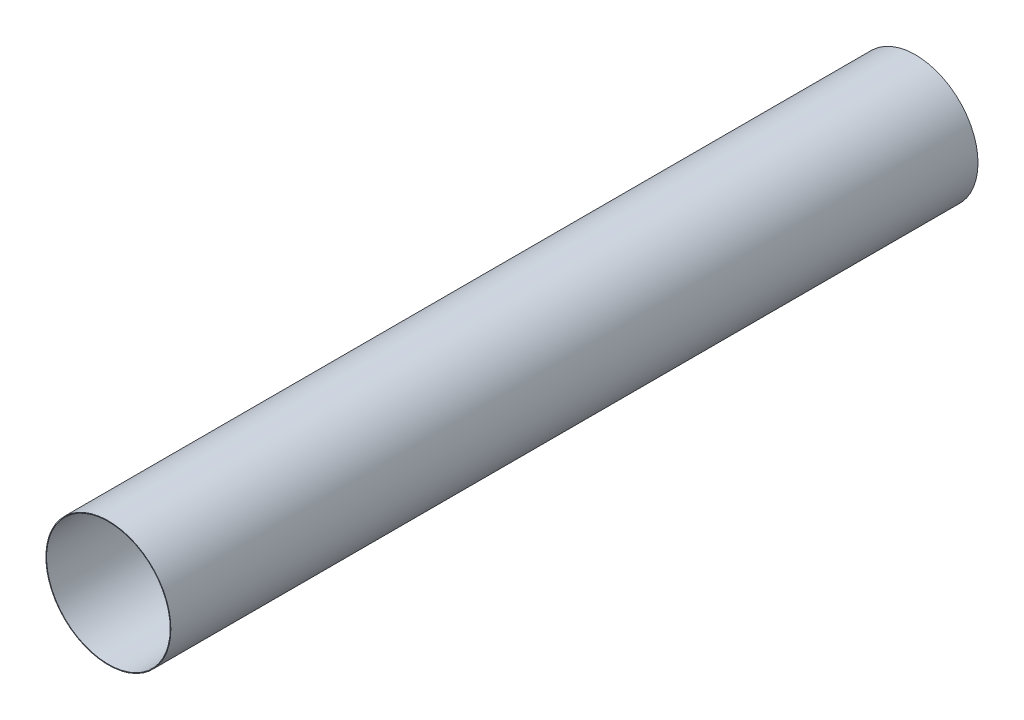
ISO-10303-21;
HEADER;
FILE_DESCRIPTION(('STEP AP214'),'2;1');
FILE_NAME('part.step','',(''),(''),'','','');
FILE_SCHEMA(('AUTOMOTIVE_DESIGN { 1 0 10303 214 1 1 1 1 }'));
ENDSEC;
DATA;
#1=APPLICATION_CONTEXT('core data for automotive mechanical design processes');
#2=APPLICATION_PROTOCOL_DEFINITION('international standard','automotive_design',2000,#1);
#3=PRODUCT_CONTEXT('',#1,'mechanical');
#4=PRODUCT('Part','Part','',(#3));
#5=PRODUCT_RELATED_PRODUCT_CATEGORY('part','',(#4));
#6=PRODUCT_DEFINITION_FORMATION('','',#4);
#7=PRODUCT_DEFINITION_CONTEXT('part definition',#1,'design');
#8=PRODUCT_DEFINITION('design','',#6,#7);
#9=PRODUCT_DEFINITION_SHAPE('','',#8);
#10=(LENGTH_UNIT() NAMED_UNIT(*) SI_UNIT(.MILLI.,.METRE.));
#11=(NAMED_UNIT(*) PLANE_ANGLE_UNIT() SI_UNIT($,.RADIAN.));
#12=(NAMED_UNIT(*) SI_UNIT($,.STERADIAN.) SOLID_ANGLE_UNIT());
#13=UNCERTAINTY_MEASURE_WITH_UNIT(LENGTH_MEASURE(1.E-05),#10,'distance_accuracy_value','');
#14=(GEOMETRIC_REPRESENTATION_CONTEXT(3) GLOBAL_UNCERTAINTY_ASSIGNED_CONTEXT((#13)) GLOBAL_UNIT_ASSIGNED_CONTEXT((#10,
#11,#12)) REPRESENTATION_CONTEXT('',''));
#15=CARTESIAN_POINT('',(0.,0.,0.));
#16=DIRECTION('',(0.,0.,1.));
#17=DIRECTION('',(1.,0.,0.));
#18=AXIS2_PLACEMENT_3D('',#15,#16,#17);
#19=CARTESIAN_POINT('',(0.,0.,-248.));
#20=DIRECTION('',(0.,0.,1.));
#21=DIRECTION('',(1.,0.,0.));
#22=AXIS2_PLACEMENT_3D('',#19,#20,#21);
#23=CYLINDRICAL_SURFACE('',#22,19.2);
#24=CARTESIAN_POINT('',(0.,0.,-248.));
#25=DIRECTION('',(0.,0.,1.));
#26=DIRECTION('',(1.,0.,0.));
#27=AXIS2_PLACEMENT_3D('',#24,#25,#26);
#28=CIRCLE('',#27,19.2);
#29=CARTESIAN_POINT('',(19.2,0.,-248.));
#30=VERTEX_POINT('',#29);
#31=EDGE_CURVE('E10',#30,#30,#28,.T.);
#32=ORIENTED_EDGE('',*,*,#31,.T.);
#33=EDGE_LOOP('',(#32));
#34=FACE_BOUND('',#33,.T.);
#35=CARTESIAN_POINT('',(0.,0.,0.));
#36=DIRECTION('',(0.,0.,1.));
#37=DIRECTION('',(1.,0.,0.));
#38=AXIS2_PLACEMENT_3D('',#35,#36,#37);
#39=CIRCLE('',#38,19.2);
#40=CARTESIAN_POINT('',(19.2,0.,0.));
#41=VERTEX_POINT('',#40);
#42=EDGE_CURVE('E37',#41,#41,#39,.T.);
#43=ORIENTED_EDGE('',*,*,#42,.F.);
#44=EDGE_LOOP('',(#43));
#45=FACE_BOUND('',#44,.T.);
#46=ADVANCED_FACE('F34',(#34,#45),#23,.T.);
#47=CARTESIAN_POINT('',(0.,0.,-248.));
#48=DIRECTION('',(0.,0.,1.));
#49=DIRECTION('',(1.,0.,0.));
#50=AXIS2_PLACEMENT_3D('',#47,#48,#49);
#51=PLANE('',#50);
#52=CARTESIAN_POINT('',(0.,0.,-248.));
#53=DIRECTION('',(0.,0.,1.));
#54=DIRECTION('',(1.,0.,0.));
#55=AXIS2_PLACEMENT_3D('',#52,#53,#54);
#56=CIRCLE('',#55,19.);
#57=CARTESIAN_POINT('',(19.,0.,-248.));
#58=VERTEX_POINT('',#57);
#59=EDGE_CURVE('E44',#58,#58,#56,.T.);
#60=ORIENTED_EDGE('',*,*,#59,.T.);
#61=EDGE_LOOP('',(#60));
#62=FACE_BOUND('',#61,.T.);
#63=ORIENTED_EDGE('',*,*,#31,.F.);
#64=EDGE_LOOP('',(#63));
#65=FACE_BOUND('',#64,.T.);
#66=ADVANCED_FACE('F52',(#62,#65),#51,.F.);
#67=CARTESIAN_POINT('',(0.,0.,0.));
#68=DIRECTION('',(0.,0.,1.));
#69=DIRECTION('',(1.,0.,0.));
#70=AXIS2_PLACEMENT_3D('',#67,#68,#69);
#71=PLANE('',#70);
#72=CARTESIAN_POINT('',(0.,0.,0.));
#73=DIRECTION('',(0.,0.,1.));
#74=DIRECTION('',(1.,0.,0.));
#75=AXIS2_PLACEMENT_3D('',#72,#73,#74);
#76=CIRCLE('',#75,19.);
#77=CARTESIAN_POINT('',(19.,0.,0.));
#78=VERTEX_POINT('',#77);
#79=EDGE_CURVE('E46',#78,#78,#76,.T.);
#80=ORIENTED_EDGE('',*,*,#79,.F.);
#81=EDGE_LOOP('',(#80));
#82=FACE_BOUND('',#81,.T.);
#83=ORIENTED_EDGE('',*,*,#42,.T.);
#84=EDGE_LOOP('',(#83));
#85=FACE_BOUND('',#84,.T.);
#86=ADVANCED_FACE('F58',(#82,#85),#71,.T.);
#87=CARTESIAN_POINT('',(0.,0.,-248.));
#88=DIRECTION('',(0.,0.,1.));
#89=DIRECTION('',(1.,0.,0.));
#90=AXIS2_PLACEMENT_3D('',#87,#88,#89);
#91=CYLINDRICAL_SURFACE('',#90,19.);
#92=ORIENTED_EDGE('',*,*,#59,.F.);
#93=EDGE_LOOP('',(#92));
#94=FACE_BOUND('',#93,.T.);
#95=ORIENTED_EDGE('',*,*,#79,.T.);
#96=EDGE_LOOP('',(#95));
#97=FACE_BOUND('',#96,.T.);
#98=ADVANCED_FACE('F55',(#94,#97),#91,.F.);
#99=CLOSED_SHELL('',(#46,#66,#86,#98));
#100=MANIFOLD_SOLID_BREP('B2',#99);
#101=ADVANCED_BREP_SHAPE_REPRESENTATION('',(#18,#100),#14);
#102=SHAPE_DEFINITION_REPRESENTATION(#9,#101);
ENDSEC;
END-ISO-10303-21;
